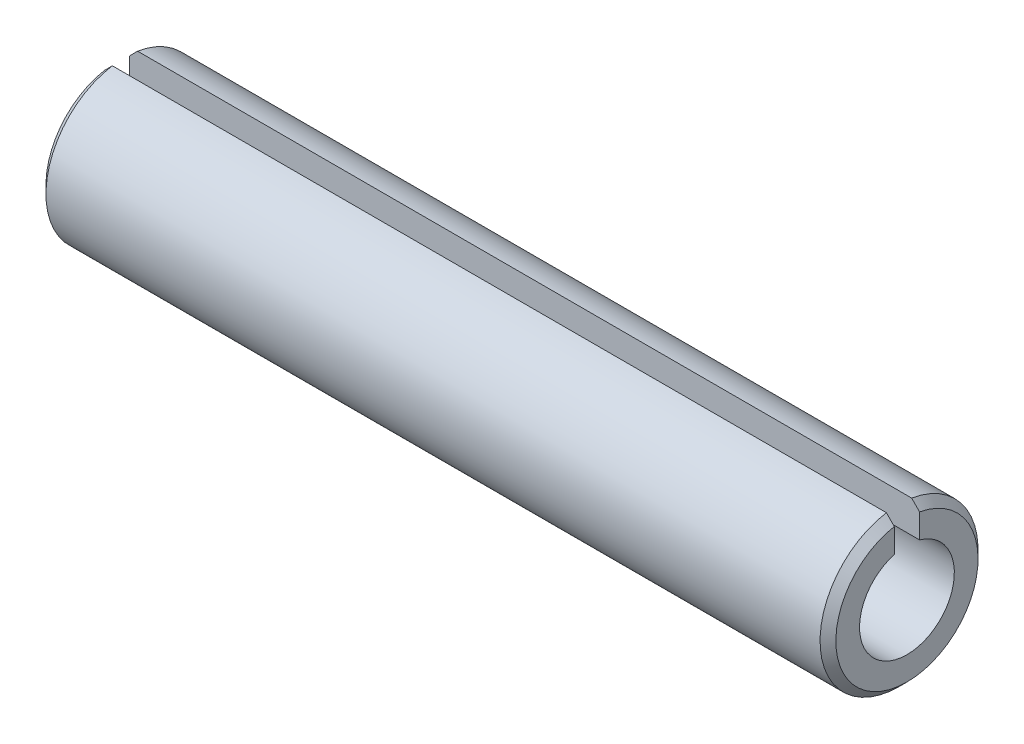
from build123d import *

# Parameters (mm, degrees)
ENL_V_MAT_EXTRU_2_DEPTH = 51.497524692


with BuildPart() as part:
    # Esquisse1 → Base-R_volution (revolve)
    with BuildSketch(Plane.XY):
        Polygon((0, 3), (0, 4.5), (0.5, 5), (49.5, 5), (50, 4.5), (50, 3), align=None)
    revolve(axis=Axis((0, 0, 0), (1, 0, 0)))

    # Esquisse2 → Enl_v. mat.-Extru.2 (cut, through all)
    with BuildSketch(Plane(origin=(0, 0, 0), x_dir=(0, 0, -1), z_dir=(1, 0, 0))):
        with BuildLine():
            Line((0.8, 4.935585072), (0.8, 2.891366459))
            ThreePointArc((0.8, 2.891366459), (0, 3), (-0.8, 2.891366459))
            Line((-0.8, 2.891366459), (-0.8, 4.935585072))
            ThreePointArc((-0.8, 4.935585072), (0, 5), (0.8, 4.935585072))
        make_face()
    extrude(amount=ENL_V_MAT_EXTRU_2_DEPTH, mode=Mode.SUBTRACT)


solid = part.part
